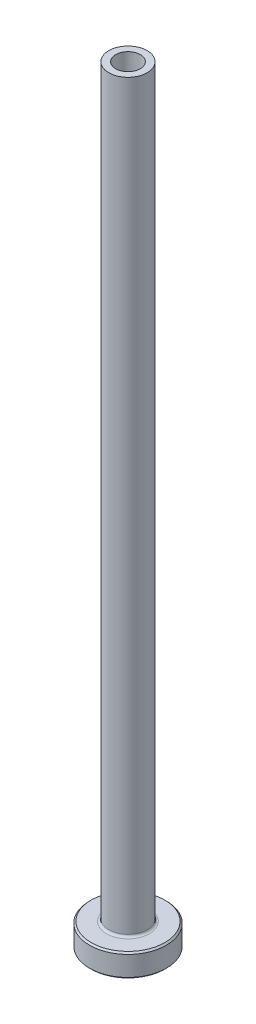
ISO-10303-21;
HEADER;
FILE_DESCRIPTION(('STEP AP214'),'2;1');
FILE_NAME('part.step','',(''),(''),'','','');
FILE_SCHEMA(('AUTOMOTIVE_DESIGN { 1 0 10303 214 1 1 1 1 }'));
ENDSEC;
DATA;
#1=APPLICATION_CONTEXT('core data for automotive mechanical design processes');
#2=APPLICATION_PROTOCOL_DEFINITION('international standard','automotive_design',2000,#1);
#3=PRODUCT_CONTEXT('',#1,'mechanical');
#4=PRODUCT('Part','Part','',(#3));
#5=PRODUCT_RELATED_PRODUCT_CATEGORY('part','',(#4));
#6=PRODUCT_DEFINITION_FORMATION('','',#4);
#7=PRODUCT_DEFINITION_CONTEXT('part definition',#1,'design');
#8=PRODUCT_DEFINITION('design','',#6,#7);
#9=PRODUCT_DEFINITION_SHAPE('','',#8);
#10=(LENGTH_UNIT() NAMED_UNIT(*) SI_UNIT(.MILLI.,.METRE.));
#11=(NAMED_UNIT(*) PLANE_ANGLE_UNIT() SI_UNIT($,.RADIAN.));
#12=(NAMED_UNIT(*) SI_UNIT($,.STERADIAN.) SOLID_ANGLE_UNIT());
#13=UNCERTAINTY_MEASURE_WITH_UNIT(LENGTH_MEASURE(1.E-05),#10,'distance_accuracy_value','');
#14=(GEOMETRIC_REPRESENTATION_CONTEXT(3) GLOBAL_UNCERTAINTY_ASSIGNED_CONTEXT((#13)) GLOBAL_UNIT_ASSIGNED_CONTEXT((#10,
#11,#12)) REPRESENTATION_CONTEXT('',''));
#15=CARTESIAN_POINT('',(0.,0.,0.));
#16=DIRECTION('',(0.,0.,1.));
#17=DIRECTION('',(1.,0.,0.));
#18=AXIS2_PLACEMENT_3D('',#15,#16,#17);
#19=CARTESIAN_POINT('',(0.,92.1876809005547,0.));
#20=DIRECTION('',(0.,1.,0.));
#21=DIRECTION('',(0.,0.,1.));
#22=AXIS2_PLACEMENT_3D('',#19,#20,#21);
#23=CYLINDRICAL_SURFACE('',#22,1.60000000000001);
#24=CARTESIAN_POINT('',(0.,100.,0.));
#25=DIRECTION('',(0.,1.,0.));
#26=DIRECTION('',(0.,0.,1.));
#27=AXIS2_PLACEMENT_3D('',#24,#25,#26);
#28=CIRCLE('',#27,1.60000000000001);
#29=CARTESIAN_POINT('',(0.,100.,1.60000000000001));
#30=VERTEX_POINT('',#29);
#31=EDGE_CURVE('E62',#30,#30,#28,.T.);
#32=ORIENTED_EDGE('',*,*,#31,.T.);
#33=EDGE_LOOP('',(#32));
#34=FACE_BOUND('',#33,.T.);
#35=CARTESIAN_POINT('',(0.,55.,0.));
#36=DIRECTION('',(0.,1.,0.));
#37=DIRECTION('',(0.,0.,1.));
#38=AXIS2_PLACEMENT_3D('',#35,#36,#37);
#39=CIRCLE('',#38,1.60000000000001);
#40=CARTESIAN_POINT('',(0.,55.,1.60000000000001));
#41=VERTEX_POINT('',#40);
#42=EDGE_CURVE('E71',#41,#41,#39,.T.);
#43=ORIENTED_EDGE('',*,*,#42,.F.);
#44=EDGE_LOOP('',(#43));
#45=FACE_BOUND('',#44,.T.);
#46=ADVANCED_FACE('F30',(#34,#45),#23,.F.);
#47=CARTESIAN_POINT('',(-1.60000000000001,100.,0.));
#48=DIRECTION('',(0.,1.,0.));
#49=DIRECTION('',(0.,0.,1.));
#50=AXIS2_PLACEMENT_3D('',#47,#48,#49);
#51=PLANE('',#50);
#52=CARTESIAN_POINT('',(0.,100.,0.));
#53=DIRECTION('',(0.,1.,0.));
#54=DIRECTION('',(0.,0.,1.));
#55=AXIS2_PLACEMENT_3D('',#52,#53,#54);
#56=CIRCLE('',#55,2.5);
#57=CARTESIAN_POINT('',(0.,100.,2.5));
#58=VERTEX_POINT('',#57);
#59=EDGE_CURVE('E65',#58,#58,#56,.T.);
#60=ORIENTED_EDGE('',*,*,#59,.T.);
#61=EDGE_LOOP('',(#60));
#62=FACE_BOUND('',#61,.T.);
#63=ORIENTED_EDGE('',*,*,#31,.F.);
#64=EDGE_LOOP('',(#63));
#65=FACE_BOUND('',#64,.T.);
#66=ADVANCED_FACE('F79',(#62,#65),#51,.T.);
#67=CARTESIAN_POINT('',(0.,92.1876809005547,0.));
#68=DIRECTION('',(0.,1.,0.));
#69=DIRECTION('',(0.,0.,1.));
#70=AXIS2_PLACEMENT_3D('',#67,#68,#69);
#71=CYLINDRICAL_SURFACE('',#70,2.49999999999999);
#72=CARTESIAN_POINT('',(0.,3.3,0.));
#73=DIRECTION('',(0.,1.,0.));
#74=DIRECTION('',(0.,0.,1.));
#75=AXIS2_PLACEMENT_3D('',#72,#73,#74);
#76=CIRCLE('',#75,2.49999999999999);
#77=CARTESIAN_POINT('',(0.,3.3,2.49999999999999));
#78=VERTEX_POINT('',#77);
#79=EDGE_CURVE('E59',#78,#78,#76,.T.);
#80=ORIENTED_EDGE('',*,*,#79,.T.);
#81=EDGE_LOOP('',(#80));
#82=FACE_BOUND('',#81,.T.);
#83=ORIENTED_EDGE('',*,*,#59,.F.);
#84=EDGE_LOOP('',(#83));
#85=FACE_BOUND('',#84,.T.);
#86=ADVANCED_FACE('F85',(#82,#85),#71,.T.);
#87=CARTESIAN_POINT('',(-2.49999999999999,3.,0.));
#88=DIRECTION('',(0.,1.,0.));
#89=DIRECTION('',(0.,0.,1.));
#90=AXIS2_PLACEMENT_3D('',#87,#88,#89);
#91=PLANE('',#90);
#92=CARTESIAN_POINT('',(0.,3.,0.));
#93=DIRECTION('',(0.,1.,0.));
#94=DIRECTION('',(0.,0.,1.));
#95=AXIS2_PLACEMENT_3D('',#92,#93,#94);
#96=CIRCLE('',#95,4.79999999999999);
#97=CARTESIAN_POINT('',(0.,3.,4.79999999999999));
#98=VERTEX_POINT('',#97);
#99=EDGE_CURVE('E53',#98,#98,#96,.T.);
#100=ORIENTED_EDGE('',*,*,#99,.T.);
#101=EDGE_LOOP('',(#100));
#102=FACE_BOUND('',#101,.T.);
#103=CARTESIAN_POINT('',(0.,3.,0.));
#104=DIRECTION('',(0.,1.,0.));
#105=DIRECTION('',(0.,0.,1.));
#106=AXIS2_PLACEMENT_3D('',#103,#104,#105);
#107=CIRCLE('',#106,2.79999999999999);
#108=CARTESIAN_POINT('',(0.,3.,2.79999999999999));
#109=VERTEX_POINT('',#108);
#110=EDGE_CURVE('E56',#109,#109,#107,.F.);
#111=ORIENTED_EDGE('',*,*,#110,.T.);
#112=EDGE_LOOP('',(#111));
#113=FACE_BOUND('',#112,.T.);
#114=ADVANCED_FACE('F111',(#102,#113),#91,.T.);
#115=CARTESIAN_POINT('',(0.,92.1876809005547,0.));
#116=DIRECTION('',(0.,1.,0.));
#117=DIRECTION('',(0.,0.,1.));
#118=AXIS2_PLACEMENT_3D('',#115,#116,#117);
#119=CYLINDRICAL_SURFACE('',#118,4.99999999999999);
#120=CARTESIAN_POINT('',(0.,2.80000000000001,0.));
#121=DIRECTION('',(0.,1.,0.));
#122=DIRECTION('',(0.,0.,1.));
#123=AXIS2_PLACEMENT_3D('',#120,#121,#122);
#124=CIRCLE('',#123,4.99999999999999);
#125=CARTESIAN_POINT('',(0.,2.80000000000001,4.99999999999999));
#126=VERTEX_POINT('',#125);
#127=EDGE_CURVE('E45',#126,#126,#124,.F.);
#128=ORIENTED_EDGE('',*,*,#127,.T.);
#129=EDGE_LOOP('',(#128));
#130=FACE_BOUND('',#129,.T.);
#131=CARTESIAN_POINT('',(0.,0.20000000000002,0.));
#132=DIRECTION('',(0.,-1.,0.));
#133=DIRECTION('',(0.,0.,-1.));
#134=AXIS2_PLACEMENT_3D('',#131,#132,#133);
#135=CIRCLE('',#134,4.99999999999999);
#136=CARTESIAN_POINT('',(0.,0.20000000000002,-4.99999999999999));
#137=VERTEX_POINT('',#136);
#138=EDGE_CURVE('E50',#137,#137,#135,.F.);
#139=ORIENTED_EDGE('',*,*,#138,.T.);
#140=EDGE_LOOP('',(#139));
#141=FACE_BOUND('',#140,.T.);
#142=ADVANCED_FACE('F108',(#130,#141),#119,.T.);
#143=CARTESIAN_POINT('',(-4.99999999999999,0.,0.));
#144=DIRECTION('',(0.,-1.,0.));
#145=DIRECTION('',(0.,0.,-1.));
#146=AXIS2_PLACEMENT_3D('',#143,#144,#145);
#147=PLANE('',#146);
#148=CARTESIAN_POINT('',(0.,0.,0.));
#149=DIRECTION('',(0.,-1.,0.));
#150=DIRECTION('',(0.,0.,-1.));
#151=AXIS2_PLACEMENT_3D('',#148,#149,#150);
#152=CIRCLE('',#151,2.34999999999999);
#153=CARTESIAN_POINT('',(0.,0.,-2.34999999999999));
#154=VERTEX_POINT('',#153);
#155=EDGE_CURVE('E37',#154,#154,#152,.F.);
#156=ORIENTED_EDGE('',*,*,#155,.T.);
#157=EDGE_LOOP('',(#156));
#158=FACE_BOUND('',#157,.T.);
#159=CARTESIAN_POINT('',(0.,0.,0.));
#160=DIRECTION('',(0.,-1.,0.));
#161=DIRECTION('',(0.,0.,-1.));
#162=AXIS2_PLACEMENT_3D('',#159,#160,#161);
#163=CIRCLE('',#162,4.79999999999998);
#164=CARTESIAN_POINT('',(0.,0.,-4.79999999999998));
#165=VERTEX_POINT('',#164);
#166=EDGE_CURVE('E41',#165,#165,#163,.T.);
#167=ORIENTED_EDGE('',*,*,#166,.T.);
#168=EDGE_LOOP('',(#167));
#169=FACE_BOUND('',#168,.T.);
#170=ADVANCED_FACE('F110',(#158,#169),#147,.T.);
#171=CARTESIAN_POINT('',(0.,92.1876809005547,0.));
#172=DIRECTION('',(0.,1.,0.));
#173=DIRECTION('',(0.,0.,1.));
#174=AXIS2_PLACEMENT_3D('',#171,#172,#173);
#175=CYLINDRICAL_SURFACE('',#174,1.84999999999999);
#176=CARTESIAN_POINT('',(0.,0.5,0.));
#177=DIRECTION('',(0.,-1.,0.));
#178=DIRECTION('',(0.,0.,-1.));
#179=AXIS2_PLACEMENT_3D('',#176,#177,#178);
#180=CIRCLE('',#179,1.84999999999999);
#181=CARTESIAN_POINT('',(0.,0.5,-1.84999999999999));
#182=VERTEX_POINT('',#181);
#183=EDGE_CURVE('E10',#182,#182,#180,.T.);
#184=ORIENTED_EDGE('',*,*,#183,.T.);
#185=EDGE_LOOP('',(#184));
#186=FACE_BOUND('',#185,.T.);
#187=CARTESIAN_POINT('',(0.,43.,0.));
#188=DIRECTION('',(0.,1.,0.));
#189=DIRECTION('',(0.,0.,1.));
#190=AXIS2_PLACEMENT_3D('',#187,#188,#189);
#191=CIRCLE('',#190,1.85);
#192=CARTESIAN_POINT('',(0.,43.,1.85));
#193=VERTEX_POINT('',#192);
#194=EDGE_CURVE('E68',#193,#193,#191,.T.);
#195=ORIENTED_EDGE('',*,*,#194,.T.);
#196=EDGE_LOOP('',(#195));
#197=FACE_BOUND('',#196,.T.);
#198=ADVANCED_FACE('F118',(#186,#197),#175,.F.);
#199=CARTESIAN_POINT('',(0.,43.,0.));
#200=DIRECTION('',(0.,-1.,0.));
#201=DIRECTION('',(0.,0.,-1.));
#202=AXIS2_PLACEMENT_3D('',#199,#200,#201);
#203=CONICAL_SURFACE('',#202,1.85,0.020830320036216);
#204=ORIENTED_EDGE('',*,*,#42,.T.);
#205=EDGE_LOOP('',(#204));
#206=FACE_BOUND('',#205,.T.);
#207=ORIENTED_EDGE('',*,*,#194,.F.);
#208=EDGE_LOOP('',(#207));
#209=FACE_BOUND('',#208,.T.);
#210=ADVANCED_FACE('F75',(#206,#209),#203,.F.);
#211=CARTESIAN_POINT('',(0.,3.3,0.));
#212=DIRECTION('',(0.,1.,0.));
#213=DIRECTION('',(0.,0.,1.));
#214=AXIS2_PLACEMENT_3D('',#211,#212,#213);
#215=TOROIDAL_SURFACE('',#214,2.79999999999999,0.3);
#216=ORIENTED_EDGE('',*,*,#110,.F.);
#217=EDGE_LOOP('',(#216));
#218=FACE_BOUND('',#217,.T.);
#219=ORIENTED_EDGE('',*,*,#79,.F.);
#220=EDGE_LOOP('',(#219));
#221=FACE_BOUND('',#220,.T.);
#222=ADVANCED_FACE('F90',(#218,#221),#215,.F.);
#223=CARTESIAN_POINT('',(0.,3.,0.));
#224=DIRECTION('',(0.,-1.,0.));
#225=DIRECTION('',(0.,0.,-1.));
#226=AXIS2_PLACEMENT_3D('',#223,#224,#225);
#227=CONICAL_SURFACE('',#226,4.79999999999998,0.785398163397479);
#228=ORIENTED_EDGE('',*,*,#127,.F.);
#229=EDGE_LOOP('',(#228));
#230=FACE_BOUND('',#229,.T.);
#231=ORIENTED_EDGE('',*,*,#99,.F.);
#232=EDGE_LOOP('',(#231));
#233=FACE_BOUND('',#232,.T.);
#234=ADVANCED_FACE('F93',(#230,#233),#227,.T.);
#235=CARTESIAN_POINT('',(0.,0.20000000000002,0.));
#236=DIRECTION('',(0.,1.,0.));
#237=DIRECTION('',(0.,0.,1.));
#238=AXIS2_PLACEMENT_3D('',#235,#236,#237);
#239=CONICAL_SURFACE('',#238,4.99999999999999,0.785398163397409);
#240=ORIENTED_EDGE('',*,*,#166,.F.);
#241=EDGE_LOOP('',(#240));
#242=FACE_BOUND('',#241,.T.);
#243=ORIENTED_EDGE('',*,*,#138,.F.);
#244=EDGE_LOOP('',(#243));
#245=FACE_BOUND('',#244,.T.);
#246=ADVANCED_FACE('F96',(#242,#245),#239,.T.);
#247=CARTESIAN_POINT('',(0.,0.,0.));
#248=DIRECTION('',(0.,-1.,0.));
#249=DIRECTION('',(0.,0.,-1.));
#250=AXIS2_PLACEMENT_3D('',#247,#248,#249);
#251=CONICAL_SURFACE('',#250,2.34999999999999,0.785398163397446);
#252=ORIENTED_EDGE('',*,*,#183,.F.);
#253=EDGE_LOOP('',(#252));
#254=FACE_BOUND('',#253,.T.);
#255=ORIENTED_EDGE('',*,*,#155,.F.);
#256=EDGE_LOOP('',(#255));
#257=FACE_BOUND('',#256,.T.);
#258=ADVANCED_FACE('F32',(#254,#257),#251,.F.);
#259=CLOSED_SHELL('',(#46,#66,#86,#114,#142,#170,#198,#210,#222,#234,#246,#258));
#260=MANIFOLD_SOLID_BREP('B2',#259);
#261=ADVANCED_BREP_SHAPE_REPRESENTATION('',(#18,#260),#14);
#262=SHAPE_DEFINITION_REPRESENTATION(#9,#261);
ENDSEC;
END-ISO-10303-21;
